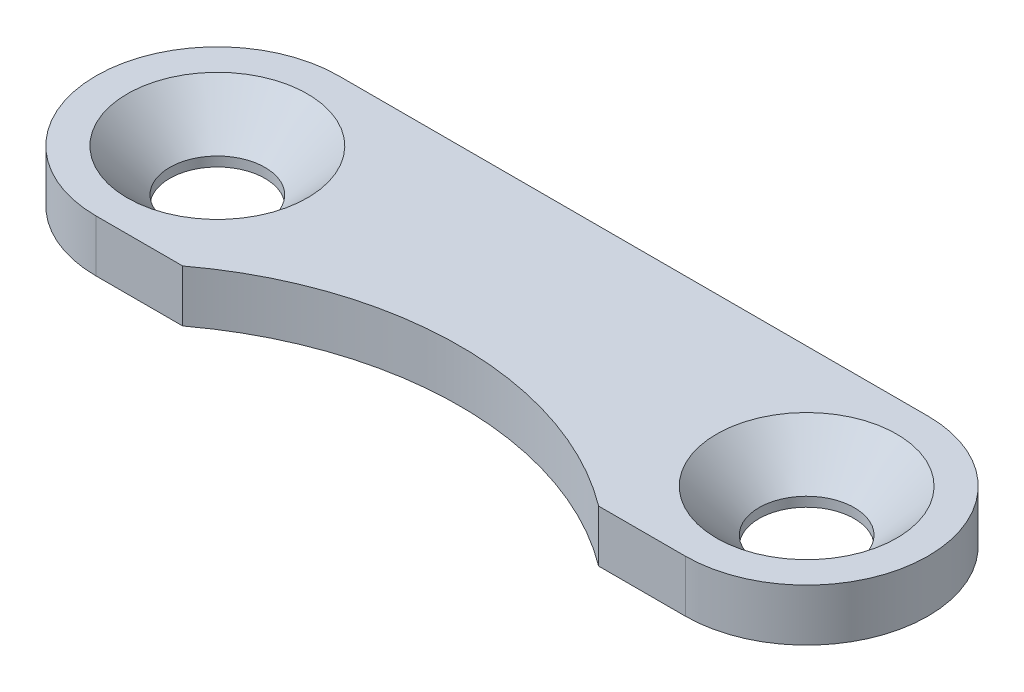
from build123d import *

# Parameters (mm, degrees)
EXTRUDE1_DEPTH                               = 3
CSK_FOR_M5_COUNTERSUNK_FLAT_HEAD_SCR_2_COUNT = 2
CSK_FOR_M5_COUNTERSUNK_FLAT_HEAD_SCR_2_PITCH = 34


with BuildPart() as part:
    # Sketch1 → Extrude1 (new body)
    with BuildSketch(Plane(origin=(0, 0, 0), x_dir=(1, 0, 0), z_dir=(0, 1, 0))):
        with BuildLine():
            Line((-17, 7), (17, 7))
            ThreePointArc((17, 7), (24, 0), (17, -7))
            Line((17, -7), (12, -7))
            ThreePointArc((12, -7), (0, -3), (-12, -7))
            Line((-12, -7), (-17, -7))
            ThreePointArc((-17, -7), (-24, 0), (-17, 7))
        make_face()
    extrude(amount=EXTRUDE1_DEPTH)

    # Sketch4 → CSK for M5 Countersunk Flat Head Screw1 (revolve, cut)
    with BuildSketch(Plane(origin=(-17, 3, 0), x_dir=(0, 0, 1), z_dir=(1, 0, 0))):
        Polygon((0, 0), (0, 3), (2.75, 3), (2.75, 2.45), (5.2, 0), align=None)
    csk_for_m5_countersunk_flat_head_screw1 = revolve(axis=Axis((-17, 9.35, 0), (0, -1, 0)), mode=Mode.SUBTRACT)

    # CSK for M5 Countersunk Flat Head Scr 2: CSK for M5 Countersunk Flat Head Screw1 ×2
    with Locations(*[(i * CSK_FOR_M5_COUNTERSUNK_FLAT_HEAD_SCR_2_PITCH, 0, 0) for i in range(1, CSK_FOR_M5_COUNTERSUNK_FLAT_HEAD_SCR_2_COUNT)]):
        add(csk_for_m5_countersunk_flat_head_screw1, mode=Mode.SUBTRACT)


solid = part.part
